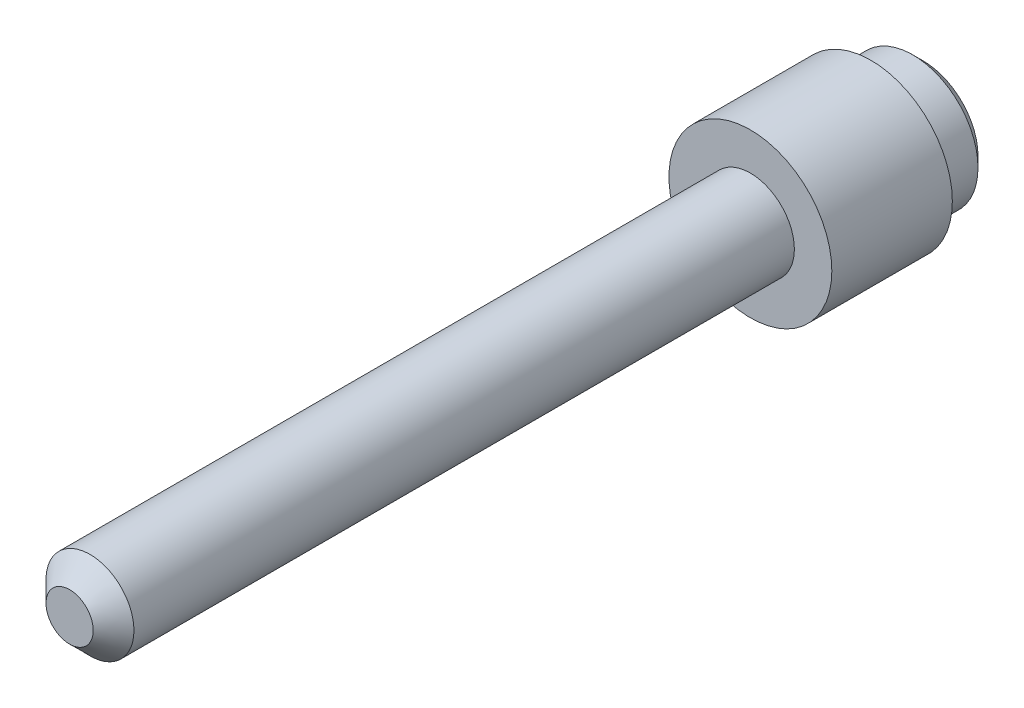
ISO-10303-21;
HEADER;
FILE_DESCRIPTION(('STEP AP214'),'2;1');
FILE_NAME('part.step','',(''),(''),'','','');
FILE_SCHEMA(('AUTOMOTIVE_DESIGN { 1 0 10303 214 1 1 1 1 }'));
ENDSEC;
DATA;
#1=APPLICATION_CONTEXT('core data for automotive mechanical design processes');
#2=APPLICATION_PROTOCOL_DEFINITION('international standard','automotive_design',2000,#1);
#3=PRODUCT_CONTEXT('',#1,'mechanical');
#4=PRODUCT('Part','Part','',(#3));
#5=PRODUCT_RELATED_PRODUCT_CATEGORY('part','',(#4));
#6=PRODUCT_DEFINITION_FORMATION('','',#4);
#7=PRODUCT_DEFINITION_CONTEXT('part definition',#1,'design');
#8=PRODUCT_DEFINITION('design','',#6,#7);
#9=PRODUCT_DEFINITION_SHAPE('','',#8);
#10=(LENGTH_UNIT() NAMED_UNIT(*) SI_UNIT(.MILLI.,.METRE.));
#11=(NAMED_UNIT(*) PLANE_ANGLE_UNIT() SI_UNIT($,.RADIAN.));
#12=(NAMED_UNIT(*) SI_UNIT($,.STERADIAN.) SOLID_ANGLE_UNIT());
#13=UNCERTAINTY_MEASURE_WITH_UNIT(LENGTH_MEASURE(1.E-05),#10,'distance_accuracy_value','');
#14=(GEOMETRIC_REPRESENTATION_CONTEXT(3) GLOBAL_UNCERTAINTY_ASSIGNED_CONTEXT((#13)) GLOBAL_UNIT_ASSIGNED_CONTEXT((#10,
#11,#12)) REPRESENTATION_CONTEXT('',''));
#15=CARTESIAN_POINT('',(0.,0.,0.));
#16=DIRECTION('',(0.,0.,1.));
#17=DIRECTION('',(1.,0.,0.));
#18=AXIS2_PLACEMENT_3D('',#15,#16,#17);
#19=CARTESIAN_POINT('',(0.,0.,0.));
#20=DIRECTION('',(0.,0.,-1.));
#21=DIRECTION('',(-1.,0.,0.));
#22=AXIS2_PLACEMENT_3D('',#19,#20,#21);
#23=PLANE('',#22);
#24=CARTESIAN_POINT('',(0.,0.,0.));
#25=DIRECTION('',(0.,0.,1.));
#26=DIRECTION('',(1.,0.,0.));
#27=AXIS2_PLACEMENT_3D('',#24,#25,#26);
#28=CIRCLE('',#27,0.92075);
#29=CARTESIAN_POINT('',(0.92075,0.,0.));
#30=VERTEX_POINT('',#29);
#31=EDGE_CURVE('E10',#30,#30,#28,.T.);
#32=ORIENTED_EDGE('',*,*,#31,.T.);
#33=EDGE_LOOP('',(#32));
#34=FACE_BOUND('',#33,.T.);
#35=ADVANCED_FACE('F33',(#34),#23,.F.);
#36=CARTESIAN_POINT('',(0.,0.,-0.79375));
#37=DIRECTION('',(0.,0.,-1.));
#38=DIRECTION('',(-1.,0.,0.));
#39=AXIS2_PLACEMENT_3D('',#36,#37,#38);
#40=CONICAL_SURFACE('',#39,1.7145,0.785398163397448);
#41=ORIENTED_EDGE('',*,*,#31,.F.);
#42=EDGE_LOOP('',(#41));
#43=FACE_BOUND('',#42,.T.);
#44=CARTESIAN_POINT('',(0.,0.,-0.79375));
#45=DIRECTION('',(0.,0.,1.));
#46=DIRECTION('',(1.,0.,0.));
#47=AXIS2_PLACEMENT_3D('',#44,#45,#46);
#48=CIRCLE('',#47,1.7145);
#49=CARTESIAN_POINT('',(1.7145,0.,-0.79375));
#50=VERTEX_POINT('',#49);
#51=EDGE_CURVE('E39',#50,#50,#48,.T.);
#52=ORIENTED_EDGE('',*,*,#51,.T.);
#53=EDGE_LOOP('',(#52));
#54=FACE_BOUND('',#53,.T.);
#55=ADVANCED_FACE('F77',(#43,#54),#40,.T.);
#56=CARTESIAN_POINT('',(0.,0.,0.));
#57=DIRECTION('',(0.,0.,1.));
#58=DIRECTION('',(1.,0.,0.));
#59=AXIS2_PLACEMENT_3D('',#56,#57,#58);
#60=CYLINDRICAL_SURFACE('',#59,1.7145);
#61=ORIENTED_EDGE('',*,*,#51,.F.);
#62=EDGE_LOOP('',(#61));
#63=FACE_BOUND('',#62,.T.);
#64=CARTESIAN_POINT('',(0.,0.,-26.543));
#65=DIRECTION('',(0.,0.,1.));
#66=DIRECTION('',(1.,0.,0.));
#67=AXIS2_PLACEMENT_3D('',#64,#65,#66);
#68=CIRCLE('',#67,1.7145);
#69=CARTESIAN_POINT('',(1.7145,0.,-26.543));
#70=VERTEX_POINT('',#69);
#71=EDGE_CURVE('E43',#70,#70,#68,.T.);
#72=ORIENTED_EDGE('',*,*,#71,.T.);
#73=EDGE_LOOP('',(#72));
#74=FACE_BOUND('',#73,.T.);
#75=ADVANCED_FACE('F81',(#63,#74),#60,.T.);
#76=CARTESIAN_POINT('',(0.,1.7145,-26.543));
#77=DIRECTION('',(0.,0.,-1.));
#78=DIRECTION('',(-1.,0.,0.));
#79=AXIS2_PLACEMENT_3D('',#76,#77,#78);
#80=PLANE('',#79);
#81=ORIENTED_EDGE('',*,*,#71,.F.);
#82=EDGE_LOOP('',(#81));
#83=FACE_BOUND('',#82,.T.);
#84=CARTESIAN_POINT('',(0.,0.,-26.543));
#85=DIRECTION('',(0.,0.,1.));
#86=DIRECTION('',(1.,0.,0.));
#87=AXIS2_PLACEMENT_3D('',#84,#85,#86);
#88=CIRCLE('',#87,3.175);
#89=CARTESIAN_POINT('',(3.175,0.,-26.543));
#90=VERTEX_POINT('',#89);
#91=EDGE_CURVE('E47',#90,#90,#88,.T.);
#92=ORIENTED_EDGE('',*,*,#91,.T.);
#93=EDGE_LOOP('',(#92));
#94=FACE_BOUND('',#93,.T.);
#95=ADVANCED_FACE('F86',(#83,#94),#80,.F.);
#96=CARTESIAN_POINT('',(0.,0.,0.));
#97=DIRECTION('',(0.,0.,1.));
#98=DIRECTION('',(1.,0.,0.));
#99=AXIS2_PLACEMENT_3D('',#96,#97,#98);
#100=CYLINDRICAL_SURFACE('',#99,3.175);
#101=ORIENTED_EDGE('',*,*,#91,.F.);
#102=EDGE_LOOP('',(#101));
#103=FACE_BOUND('',#102,.T.);
#104=CARTESIAN_POINT('',(0.,0.,-31.242));
#105=DIRECTION('',(0.,0.,1.));
#106=DIRECTION('',(1.,0.,0.));
#107=AXIS2_PLACEMENT_3D('',#104,#105,#106);
#108=CIRCLE('',#107,3.175);
#109=CARTESIAN_POINT('',(3.175,0.,-31.242));
#110=VERTEX_POINT('',#109);
#111=EDGE_CURVE('E52',#110,#110,#108,.T.);
#112=ORIENTED_EDGE('',*,*,#111,.T.);
#113=EDGE_LOOP('',(#112));
#114=FACE_BOUND('',#113,.T.);
#115=ADVANCED_FACE('F92',(#103,#114),#100,.T.);
#116=CARTESIAN_POINT('',(0.,3.175,-31.242));
#117=DIRECTION('',(0.,0.,1.));
#118=DIRECTION('',(1.,0.,0.));
#119=AXIS2_PLACEMENT_3D('',#116,#117,#118);
#120=PLANE('',#119);
#121=ORIENTED_EDGE('',*,*,#111,.F.);
#122=EDGE_LOOP('',(#121));
#123=FACE_BOUND('',#122,.T.);
#124=CARTESIAN_POINT('',(0.,0.,-31.242));
#125=DIRECTION('',(0.,0.,1.));
#126=DIRECTION('',(1.,0.,0.));
#127=AXIS2_PLACEMENT_3D('',#124,#125,#126);
#128=CIRCLE('',#127,2.54);
#129=CARTESIAN_POINT('',(2.54,0.,-31.242));
#130=VERTEX_POINT('',#129);
#131=EDGE_CURVE('E55',#130,#130,#128,.T.);
#132=ORIENTED_EDGE('',*,*,#131,.T.);
#133=EDGE_LOOP('',(#132));
#134=FACE_BOUND('',#133,.T.);
#135=ADVANCED_FACE('F96',(#123,#134),#120,.F.);
#136=CARTESIAN_POINT('',(0.,0.,0.));
#137=DIRECTION('',(0.,0.,1.));
#138=DIRECTION('',(1.,0.,0.));
#139=AXIS2_PLACEMENT_3D('',#136,#137,#138);
#140=CYLINDRICAL_SURFACE('',#139,2.54);
#141=ORIENTED_EDGE('',*,*,#131,.F.);
#142=EDGE_LOOP('',(#141));
#143=FACE_BOUND('',#142,.T.);
#144=CARTESIAN_POINT('',(0.,0.,-32.877125));
#145=DIRECTION('',(0.,0.,1.));
#146=DIRECTION('',(1.,0.,0.));
#147=AXIS2_PLACEMENT_3D('',#144,#145,#146);
#148=CIRCLE('',#147,2.54);
#149=CARTESIAN_POINT('',(2.54,0.,-32.877125));
#150=VERTEX_POINT('',#149);
#151=EDGE_CURVE('E58',#150,#150,#148,.T.);
#152=ORIENTED_EDGE('',*,*,#151,.T.);
#153=EDGE_LOOP('',(#152));
#154=FACE_BOUND('',#153,.T.);
#155=ADVANCED_FACE('F73',(#143,#154),#140,.T.);
#156=CARTESIAN_POINT('',(0.,0.,-33.274));
#157=DIRECTION('',(0.,0.,1.));
#158=DIRECTION('',(1.,0.,0.));
#159=AXIS2_PLACEMENT_3D('',#156,#157,#158);
#160=CONICAL_SURFACE('',#159,2.143125,0.78539816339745);
#161=ORIENTED_EDGE('',*,*,#151,.F.);
#162=EDGE_LOOP('',(#161));
#163=FACE_BOUND('',#162,.T.);
#164=CARTESIAN_POINT('',(0.,0.,-33.274));
#165=DIRECTION('',(0.,0.,1.));
#166=DIRECTION('',(1.,0.,0.));
#167=AXIS2_PLACEMENT_3D('',#164,#165,#166);
#168=CIRCLE('',#167,2.143125);
#169=CARTESIAN_POINT('',(2.143125,0.,-33.274));
#170=VERTEX_POINT('',#169);
#171=EDGE_CURVE('E61',#170,#170,#168,.T.);
#172=ORIENTED_EDGE('',*,*,#171,.T.);
#173=EDGE_LOOP('',(#172));
#174=FACE_BOUND('',#173,.T.);
#175=ADVANCED_FACE('F65',(#163,#174),#160,.T.);
#176=CARTESIAN_POINT('',(0.,2.143125,-33.274));
#177=DIRECTION('',(0.,0.,1.));
#178=DIRECTION('',(1.,0.,0.));
#179=AXIS2_PLACEMENT_3D('',#176,#177,#178);
#180=PLANE('',#179);
#181=ORIENTED_EDGE('',*,*,#171,.F.);
#182=EDGE_LOOP('',(#181));
#183=FACE_BOUND('',#182,.T.);
#184=ADVANCED_FACE('F67',(#183),#180,.F.);
#185=CLOSED_SHELL('',(#35,#55,#75,#95,#115,#135,#155,#175,#184));
#186=MANIFOLD_SOLID_BREP('B2',#185);
#187=ADVANCED_BREP_SHAPE_REPRESENTATION('',(#18,#186),#14);
#188=SHAPE_DEFINITION_REPRESENTATION(#9,#187);
ENDSEC;
END-ISO-10303-21;
